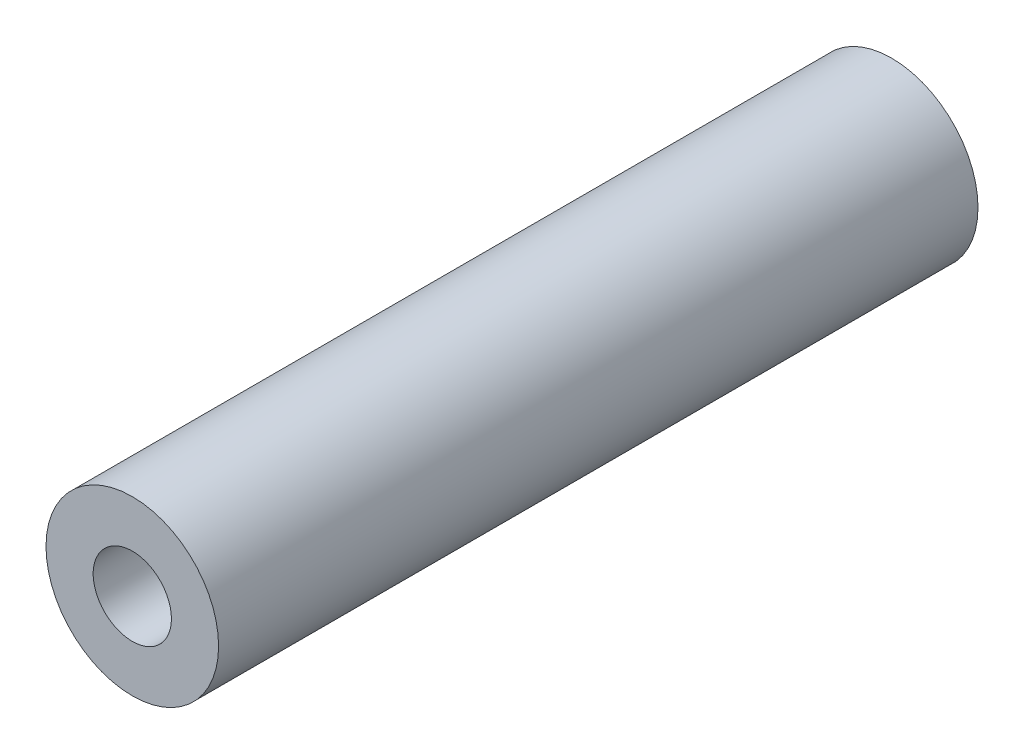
ISO-10303-21;
HEADER;
FILE_DESCRIPTION(('STEP AP214'),'2;1');
FILE_NAME('part.step','',(''),(''),'','','');
FILE_SCHEMA(('AUTOMOTIVE_DESIGN { 1 0 10303 214 1 1 1 1 }'));
ENDSEC;
DATA;
#1=APPLICATION_CONTEXT('core data for automotive mechanical design processes');
#2=APPLICATION_PROTOCOL_DEFINITION('international standard','automotive_design',2000,#1);
#3=PRODUCT_CONTEXT('',#1,'mechanical');
#4=PRODUCT('Part','Part','',(#3));
#5=PRODUCT_RELATED_PRODUCT_CATEGORY('part','',(#4));
#6=PRODUCT_DEFINITION_FORMATION('','',#4);
#7=PRODUCT_DEFINITION_CONTEXT('part definition',#1,'design');
#8=PRODUCT_DEFINITION('design','',#6,#7);
#9=PRODUCT_DEFINITION_SHAPE('','',#8);
#10=(LENGTH_UNIT() NAMED_UNIT(*) SI_UNIT(.MILLI.,.METRE.));
#11=(NAMED_UNIT(*) PLANE_ANGLE_UNIT() SI_UNIT($,.RADIAN.));
#12=(NAMED_UNIT(*) SI_UNIT($,.STERADIAN.) SOLID_ANGLE_UNIT());
#13=UNCERTAINTY_MEASURE_WITH_UNIT(LENGTH_MEASURE(1.E-05),#10,'distance_accuracy_value','');
#14=(GEOMETRIC_REPRESENTATION_CONTEXT(3) GLOBAL_UNCERTAINTY_ASSIGNED_CONTEXT((#13)) GLOBAL_UNIT_ASSIGNED_CONTEXT((#10,
#11,#12)) REPRESENTATION_CONTEXT('',''));
#15=CARTESIAN_POINT('',(0.,0.,0.));
#16=DIRECTION('',(0.,0.,1.));
#17=DIRECTION('',(1.,0.,0.));
#18=AXIS2_PLACEMENT_3D('',#15,#16,#17);
#19=CARTESIAN_POINT('',(-78.,88.,66.));
#20=DIRECTION('',(0.,0.,-1.));
#21=DIRECTION('',(-1.,0.,0.));
#22=AXIS2_PLACEMENT_3D('',#19,#20,#21);
#23=CYLINDRICAL_SURFACE('',#22,7.5);
#24=CARTESIAN_POINT('',(-78.,88.,66.));
#25=DIRECTION('',(0.,0.,1.));
#26=DIRECTION('',(1.,0.,0.));
#27=AXIS2_PLACEMENT_3D('',#24,#25,#26);
#28=CIRCLE('',#27,7.5);
#29=CARTESIAN_POINT('',(-70.5,88.,66.));
#30=VERTEX_POINT('',#29);
#31=EDGE_CURVE('E11',#30,#30,#28,.T.);
#32=ORIENTED_EDGE('',*,*,#31,.F.);
#33=EDGE_LOOP('',(#32));
#34=FACE_BOUND('',#33,.T.);
#35=CARTESIAN_POINT('',(-78.,88.,0.));
#36=DIRECTION('',(0.,0.,1.));
#37=DIRECTION('',(1.,0.,0.));
#38=AXIS2_PLACEMENT_3D('',#35,#36,#37);
#39=CIRCLE('',#38,7.5);
#40=CARTESIAN_POINT('',(-70.5,88.,0.));
#41=VERTEX_POINT('',#40);
#42=EDGE_CURVE('E19',#41,#41,#39,.T.);
#43=ORIENTED_EDGE('',*,*,#42,.T.);
#44=EDGE_LOOP('',(#43));
#45=FACE_BOUND('',#44,.T.);
#46=ADVANCED_FACE('F16',(#34,#45),#23,.T.);
#47=CARTESIAN_POINT('',(-78.,88.,66.));
#48=DIRECTION('',(0.,0.,1.));
#49=DIRECTION('',(1.,0.,0.));
#50=AXIS2_PLACEMENT_3D('',#47,#48,#49);
#51=PLANE('',#50);
#52=CARTESIAN_POINT('',(-78.,88.,66.));
#53=DIRECTION('',(0.,0.,1.));
#54=DIRECTION('',(1.,0.,0.));
#55=AXIS2_PLACEMENT_3D('',#52,#53,#54);
#56=CIRCLE('',#55,3.4);
#57=CARTESIAN_POINT('',(-74.6,88.,66.));
#58=VERTEX_POINT('',#57);
#59=EDGE_CURVE('E39',#58,#58,#56,.T.);
#60=ORIENTED_EDGE('',*,*,#59,.F.);
#61=EDGE_LOOP('',(#60));
#62=FACE_BOUND('',#61,.T.);
#63=ORIENTED_EDGE('',*,*,#31,.T.);
#64=EDGE_LOOP('',(#63));
#65=FACE_BOUND('',#64,.T.);
#66=ADVANCED_FACE('F58',(#62,#65),#51,.T.);
#67=CARTESIAN_POINT('',(-78.,88.,0.));
#68=DIRECTION('',(0.,0.,1.));
#69=DIRECTION('',(1.,0.,0.));
#70=AXIS2_PLACEMENT_3D('',#67,#68,#69);
#71=PLANE('',#70);
#72=CARTESIAN_POINT('',(-78.,88.,0.));
#73=DIRECTION('',(0.,0.,-1.));
#74=DIRECTION('',(-1.,0.,0.));
#75=AXIS2_PLACEMENT_3D('',#72,#73,#74);
#76=CIRCLE('',#75,3.4);
#77=CARTESIAN_POINT('',(-81.4,88.,0.));
#78=VERTEX_POINT('',#77);
#79=EDGE_CURVE('E40',#78,#78,#76,.T.);
#80=ORIENTED_EDGE('',*,*,#79,.F.);
#81=EDGE_LOOP('',(#80));
#82=FACE_BOUND('',#81,.T.);
#83=ORIENTED_EDGE('',*,*,#42,.F.);
#84=EDGE_LOOP('',(#83));
#85=FACE_BOUND('',#84,.T.);
#86=ADVANCED_FACE('F55',(#82,#85),#71,.F.);
#87=CARTESIAN_POINT('',(-78.,88.,47.75));
#88=DIRECTION('',(0.,0.,1.));
#89=DIRECTION('',(1.,0.,0.));
#90=AXIS2_PLACEMENT_3D('',#87,#88,#89);
#91=CONICAL_SURFACE('',#90,3.4,1.02974425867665);
#92=CARTESIAN_POINT('',(-78.,88.,45.7070738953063));
#93=VERTEX_POINT('',#92);
#94=VERTEX_LOOP('',#93);
#95=FACE_BOUND('',#94,.T.);
#96=CARTESIAN_POINT('',(-78.,88.,47.75));
#97=DIRECTION('',(0.,0.,1.));
#98=DIRECTION('',(1.,0.,0.));
#99=AXIS2_PLACEMENT_3D('',#96,#97,#98);
#100=CIRCLE('',#99,3.4);
#101=CARTESIAN_POINT('',(-74.6,88.,47.75));
#102=VERTEX_POINT('',#101);
#103=EDGE_CURVE('E43',#102,#102,#100,.T.);
#104=ORIENTED_EDGE('',*,*,#103,.T.);
#105=EDGE_LOOP('',(#104));
#106=FACE_BOUND('',#105,.T.);
#107=ADVANCED_FACE('F57',(#95,#106),#91,.F.);
#108=CARTESIAN_POINT('',(-78.,88.,66.));
#109=DIRECTION('',(0.,0.,1.));
#110=DIRECTION('',(1.,0.,0.));
#111=AXIS2_PLACEMENT_3D('',#108,#109,#110);
#112=CYLINDRICAL_SURFACE('',#111,3.4);
#113=ORIENTED_EDGE('',*,*,#103,.F.);
#114=EDGE_LOOP('',(#113));
#115=FACE_BOUND('',#114,.T.);
#116=ORIENTED_EDGE('',*,*,#59,.T.);
#117=EDGE_LOOP('',(#116));
#118=FACE_BOUND('',#117,.T.);
#119=ADVANCED_FACE('F33',(#115,#118),#112,.F.);
#120=CARTESIAN_POINT('',(-78.,88.,18.25));
#121=DIRECTION('',(0.,0.,-1.));
#122=DIRECTION('',(-1.,0.,0.));
#123=AXIS2_PLACEMENT_3D('',#120,#121,#122);
#124=CONICAL_SURFACE('',#123,3.4,1.02974425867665);
#125=CARTESIAN_POINT('',(-78.,88.,20.2929261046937));
#126=VERTEX_POINT('',#125);
#127=VERTEX_LOOP('',#126);
#128=FACE_BOUND('',#127,.T.);
#129=CARTESIAN_POINT('',(-78.,88.,18.25));
#130=DIRECTION('',(0.,0.,-1.));
#131=DIRECTION('',(-1.,0.,0.));
#132=AXIS2_PLACEMENT_3D('',#129,#130,#131);
#133=CIRCLE('',#132,3.4);
#134=CARTESIAN_POINT('',(-81.4,88.,18.25));
#135=VERTEX_POINT('',#134);
#136=EDGE_CURVE('E37',#135,#135,#133,.T.);
#137=ORIENTED_EDGE('',*,*,#136,.T.);
#138=EDGE_LOOP('',(#137));
#139=FACE_BOUND('',#138,.T.);
#140=ADVANCED_FACE('F29',(#128,#139),#124,.F.);
#141=CARTESIAN_POINT('',(-78.,88.,0.));
#142=DIRECTION('',(0.,0.,-1.));
#143=DIRECTION('',(-1.,0.,0.));
#144=AXIS2_PLACEMENT_3D('',#141,#142,#143);
#145=CYLINDRICAL_SURFACE('',#144,3.4);
#146=ORIENTED_EDGE('',*,*,#136,.F.);
#147=EDGE_LOOP('',(#146));
#148=FACE_BOUND('',#147,.T.);
#149=ORIENTED_EDGE('',*,*,#79,.T.);
#150=EDGE_LOOP('',(#149));
#151=FACE_BOUND('',#150,.T.);
#152=ADVANCED_FACE('F32',(#148,#151),#145,.F.);
#153=CLOSED_SHELL('',(#46,#66,#86,#107,#119,#140,#152));
#154=MANIFOLD_SOLID_BREP('B1',#153);
#155=ADVANCED_BREP_SHAPE_REPRESENTATION('',(#18,#154),#14);
#156=SHAPE_DEFINITION_REPRESENTATION(#9,#155);
ENDSEC;
END-ISO-10303-21;
